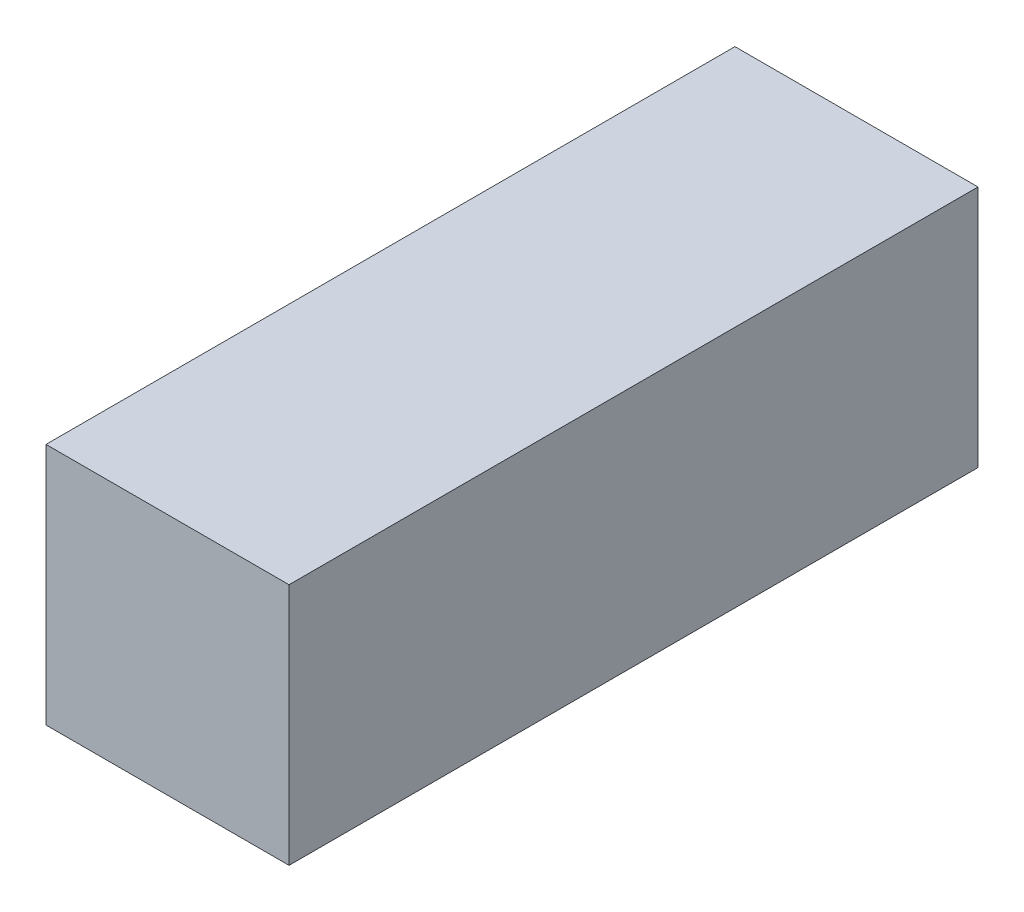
ISO-10303-21;
HEADER;
FILE_DESCRIPTION(('STEP AP214'),'2;1');
FILE_NAME('part.step','',(''),(''),'','','');
FILE_SCHEMA(('AUTOMOTIVE_DESIGN { 1 0 10303 214 1 1 1 1 }'));
ENDSEC;
DATA;
#1=APPLICATION_CONTEXT('core data for automotive mechanical design processes');
#2=APPLICATION_PROTOCOL_DEFINITION('international standard','automotive_design',2000,#1);
#3=PRODUCT_CONTEXT('',#1,'mechanical');
#4=PRODUCT('Part','Part','',(#3));
#5=PRODUCT_RELATED_PRODUCT_CATEGORY('part','',(#4));
#6=PRODUCT_DEFINITION_FORMATION('','',#4);
#7=PRODUCT_DEFINITION_CONTEXT('part definition',#1,'design');
#8=PRODUCT_DEFINITION('design','',#6,#7);
#9=PRODUCT_DEFINITION_SHAPE('','',#8);
#10=(LENGTH_UNIT() NAMED_UNIT(*) SI_UNIT(.MILLI.,.METRE.));
#11=(NAMED_UNIT(*) PLANE_ANGLE_UNIT() SI_UNIT($,.RADIAN.));
#12=(NAMED_UNIT(*) SI_UNIT($,.STERADIAN.) SOLID_ANGLE_UNIT());
#13=UNCERTAINTY_MEASURE_WITH_UNIT(LENGTH_MEASURE(1.E-05),#10,'distance_accuracy_value','');
#14=(GEOMETRIC_REPRESENTATION_CONTEXT(3) GLOBAL_UNCERTAINTY_ASSIGNED_CONTEXT((#13)) GLOBAL_UNIT_ASSIGNED_CONTEXT((#10,
#11,#12)) REPRESENTATION_CONTEXT('',''));
#15=CARTESIAN_POINT('',(0.,0.,0.));
#16=DIRECTION('',(0.,0.,1.));
#17=DIRECTION('',(1.,0.,0.));
#18=AXIS2_PLACEMENT_3D('',#15,#16,#17);
#19=CARTESIAN_POINT('',(1.5875,1.5875,9.));
#20=DIRECTION('',(-1.,0.,0.));
#21=DIRECTION('',(0.,-1.,0.));
#22=AXIS2_PLACEMENT_3D('',#19,#20,#21);
#23=PLANE('',#22);
#24=DIRECTION('',(0.,1.,0.));
#25=VECTOR('',#24,1.);
#26=CARTESIAN_POINT('',(1.5875,1.5875,0.));
#27=LINE('',#26,#25);
#28=CARTESIAN_POINT('',(1.5875,-1.5875,0.));
#29=VERTEX_POINT('',#28);
#30=CARTESIAN_POINT('',(1.5875,1.5875,0.));
#31=VERTEX_POINT('',#30);
#32=EDGE_CURVE('E95',#29,#31,#27,.T.);
#33=ORIENTED_EDGE('',*,*,#32,.T.);
#34=DIRECTION('',(0.,0.,-1.));
#35=VECTOR('',#34,1.);
#36=CARTESIAN_POINT('',(1.5875,1.5875,9.));
#37=LINE('',#36,#35);
#38=CARTESIAN_POINT('',(1.5875,1.5875,9.));
#39=VERTEX_POINT('',#38);
#40=EDGE_CURVE('E11',#39,#31,#37,.T.);
#41=ORIENTED_EDGE('',*,*,#40,.F.);
#42=DIRECTION('',(0.,1.,0.));
#43=VECTOR('',#42,1.);
#44=CARTESIAN_POINT('',(1.5875,1.5875,9.));
#45=LINE('',#44,#43);
#46=CARTESIAN_POINT('',(1.5875,-1.5875,9.));
#47=VERTEX_POINT('',#46);
#48=EDGE_CURVE('E83',#47,#39,#45,.T.);
#49=ORIENTED_EDGE('',*,*,#48,.F.);
#50=DIRECTION('',(0.,0.,-1.));
#51=VECTOR('',#50,1.);
#52=CARTESIAN_POINT('',(1.5875,-1.5875,9.));
#53=LINE('',#52,#51);
#54=EDGE_CURVE('E91',#47,#29,#53,.T.);
#55=ORIENTED_EDGE('',*,*,#54,.T.);
#56=EDGE_LOOP('',(#33,#41,#49,#55));
#57=FACE_BOUND('',#56,.T.);
#58=ADVANCED_FACE('F32',(#57),#23,.F.);
#59=CARTESIAN_POINT('',(-1.5875,1.5875,9.));
#60=DIRECTION('',(0.,-1.,0.));
#61=DIRECTION('',(0.,0.,-1.));
#62=AXIS2_PLACEMENT_3D('',#59,#60,#61);
#63=PLANE('',#62);
#64=DIRECTION('',(-1.,0.,0.));
#65=VECTOR('',#64,1.);
#66=CARTESIAN_POINT('',(-1.5875,1.5875,0.));
#67=LINE('',#66,#65);
#68=CARTESIAN_POINT('',(-1.5875,1.5875,0.));
#69=VERTEX_POINT('',#68);
#70=EDGE_CURVE('E87',#31,#69,#67,.T.);
#71=ORIENTED_EDGE('',*,*,#70,.T.);
#72=DIRECTION('',(0.,0.,-1.));
#73=VECTOR('',#72,1.);
#74=CARTESIAN_POINT('',(-1.5875,1.5875,9.));
#75=LINE('',#74,#73);
#76=CARTESIAN_POINT('',(-1.5875,1.5875,9.));
#77=VERTEX_POINT('',#76);
#78=EDGE_CURVE('E40',#77,#69,#75,.T.);
#79=ORIENTED_EDGE('',*,*,#78,.F.);
#80=DIRECTION('',(-1.,0.,0.));
#81=VECTOR('',#80,1.);
#82=CARTESIAN_POINT('',(-1.5875,1.5875,9.));
#83=LINE('',#82,#81);
#84=EDGE_CURVE('E78',#39,#77,#83,.T.);
#85=ORIENTED_EDGE('',*,*,#84,.F.);
#86=ORIENTED_EDGE('',*,*,#40,.T.);
#87=EDGE_LOOP('',(#71,#79,#85,#86));
#88=FACE_BOUND('',#87,.T.);
#89=ADVANCED_FACE('F86',(#88),#63,.F.);
#90=CARTESIAN_POINT('',(-1.5875,1.5875,9.));
#91=DIRECTION('',(1.,0.,0.));
#92=DIRECTION('',(0.,1.,0.));
#93=AXIS2_PLACEMENT_3D('',#90,#91,#92);
#94=PLANE('',#93);
#95=DIRECTION('',(0.,-1.,0.));
#96=VECTOR('',#95,1.);
#97=CARTESIAN_POINT('',(-1.5875,1.5875,0.));
#98=LINE('',#97,#96);
#99=CARTESIAN_POINT('',(-1.5875,-1.5875,0.));
#100=VERTEX_POINT('',#99);
#101=EDGE_CURVE('E65',#69,#100,#98,.T.);
#102=ORIENTED_EDGE('',*,*,#101,.T.);
#103=DIRECTION('',(0.,0.,-1.));
#104=VECTOR('',#103,1.);
#105=CARTESIAN_POINT('',(-1.5875,-1.5875,9.));
#106=LINE('',#105,#104);
#107=CARTESIAN_POINT('',(-1.5875,-1.5875,9.));
#108=VERTEX_POINT('',#107);
#109=EDGE_CURVE('E88',#108,#100,#106,.T.);
#110=ORIENTED_EDGE('',*,*,#109,.F.);
#111=DIRECTION('',(0.,-1.,0.));
#112=VECTOR('',#111,1.);
#113=CARTESIAN_POINT('',(-1.5875,1.5875,9.));
#114=LINE('',#113,#112);
#115=EDGE_CURVE('E81',#77,#108,#114,.T.);
#116=ORIENTED_EDGE('',*,*,#115,.F.);
#117=ORIENTED_EDGE('',*,*,#78,.T.);
#118=EDGE_LOOP('',(#102,#110,#116,#117));
#119=FACE_BOUND('',#118,.T.);
#120=ADVANCED_FACE('F89',(#119),#94,.F.);
#121=CARTESIAN_POINT('',(-1.5875,-1.5875,9.));
#122=DIRECTION('',(0.,1.,0.));
#123=DIRECTION('',(0.,0.,1.));
#124=AXIS2_PLACEMENT_3D('',#121,#122,#123);
#125=PLANE('',#124);
#126=DIRECTION('',(1.,0.,0.));
#127=VECTOR('',#126,1.);
#128=CARTESIAN_POINT('',(-1.5875,-1.5875,0.));
#129=LINE('',#128,#127);
#130=EDGE_CURVE('E71',#100,#29,#129,.T.);
#131=ORIENTED_EDGE('',*,*,#130,.T.);
#132=ORIENTED_EDGE('',*,*,#54,.F.);
#133=DIRECTION('',(1.,0.,0.));
#134=VECTOR('',#133,1.);
#135=CARTESIAN_POINT('',(-1.5875,-1.5875,9.));
#136=LINE('',#135,#134);
#137=EDGE_CURVE('E48',#108,#47,#136,.T.);
#138=ORIENTED_EDGE('',*,*,#137,.F.);
#139=ORIENTED_EDGE('',*,*,#109,.T.);
#140=EDGE_LOOP('',(#131,#132,#138,#139));
#141=FACE_BOUND('',#140,.T.);
#142=ADVANCED_FACE('F102',(#141),#125,.F.);
#143=CARTESIAN_POINT('',(1.5875,-1.5875,9.));
#144=DIRECTION('',(0.,0.,1.));
#145=DIRECTION('',(1.,0.,0.));
#146=AXIS2_PLACEMENT_3D('',#143,#144,#145);
#147=PLANE('',#146);
#148=ORIENTED_EDGE('',*,*,#48,.T.);
#149=ORIENTED_EDGE('',*,*,#84,.T.);
#150=ORIENTED_EDGE('',*,*,#115,.T.);
#151=ORIENTED_EDGE('',*,*,#137,.T.);
#152=EDGE_LOOP('',(#148,#149,#150,#151));
#153=FACE_BOUND('',#152,.T.);
#154=ADVANCED_FACE('F79',(#153),#147,.T.);
#155=CARTESIAN_POINT('',(1.5875,-1.5875,0.));
#156=DIRECTION('',(0.,0.,1.));
#157=DIRECTION('',(1.,0.,0.));
#158=AXIS2_PLACEMENT_3D('',#155,#156,#157);
#159=PLANE('',#158);
#160=ORIENTED_EDGE('',*,*,#32,.F.);
#161=ORIENTED_EDGE('',*,*,#130,.F.);
#162=ORIENTED_EDGE('',*,*,#101,.F.);
#163=ORIENTED_EDGE('',*,*,#70,.F.);
#164=EDGE_LOOP('',(#160,#161,#162,#163));
#165=FACE_BOUND('',#164,.T.);
#166=ADVANCED_FACE('F105',(#165),#159,.F.);
#167=CLOSED_SHELL('',(#58,#89,#120,#142,#154,#166));
#168=MANIFOLD_SOLID_BREP('B2',#167);
#169=ADVANCED_BREP_SHAPE_REPRESENTATION('',(#18,#168),#14);
#170=SHAPE_DEFINITION_REPRESENTATION(#9,#169);
ENDSEC;
END-ISO-10303-21;
